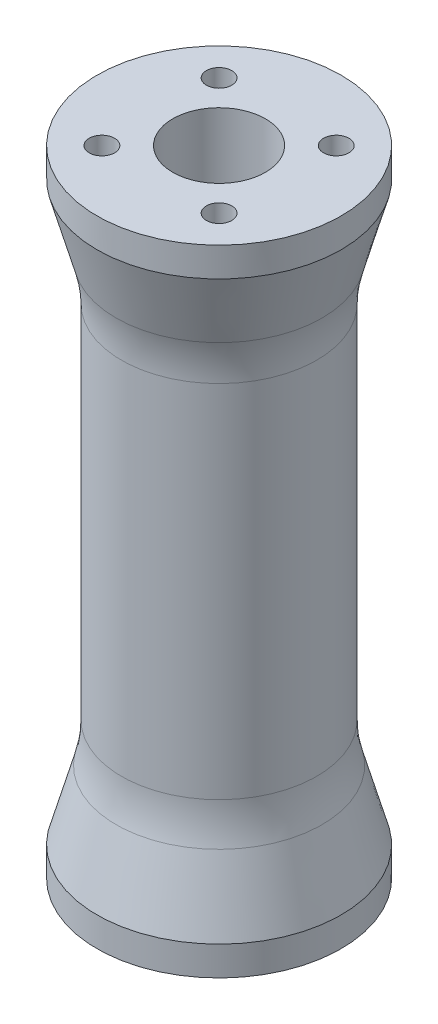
from build123d import *

# Parameters (mm, degrees)
SKETCH2_R          = 1.3
CUT_EXTRUDE1_DEPTH = 7
SKETCH5_R          = 4.75
CUT_EXTRUDE2_DEPTH = 68.360967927
FILLET1_R          = 15
FILLET2_R          = 4


with BuildPart() as part:
    # Sketch1 → Revolve1 (revolve)
    with BuildSketch(Plane.XY, mode=Mode.PRIVATE) as revolve1_sk:
        Polygon((0, -32.5), (0, 32.5), (-12.5, 32.5), (-12.5, 29.5), (-10, 20.5), (-10, -20.5), (-12.5, -29.5), (-12.5, -32.5), align=None)
    revolve(revolve1_sk.sketch.rotate(Axis((0, -32.5, 0), (0, 1, 0)), 270), axis=Axis((0, -32.5, 0), (0, 1, 0)))

    # Sketch2 → Cut-Extrude1 (cut)
    with BuildSketch(Plane(origin=(0, 32.5, 0), x_dir=(1, 0, 0), z_dir=(0, 1, 0))):
        with Locations(Location((-6, 6, 0), (0, 0, 270))):
            Circle(SKETCH2_R)
        with Locations(Location((6, 6, 0), (0, 0, 270))):
            Circle(SKETCH2_R)
        with Locations(Location((-6, -6, 0), (0, 0, 270))):
            Circle(SKETCH2_R)
        with Locations(Location((6, -6, 0), (0, 0, 270))):
            Circle(SKETCH2_R)
    cut_extrude1 = extrude(amount=-CUT_EXTRUDE1_DEPTH, mode=Mode.SUBTRACT)

    # Mirror1: Cut-Extrude1 across plane
    add(cut_extrude1.mirror(Plane.ZX), mode=Mode.SUBTRACT)

    # Sketch4 → Cut-Revolve1 (revolve, cut)
    with BuildSketch(Plane.XY):
        Polygon((0, 29.7), (-9, 20.7), (-9, -20.7), (0, -29.7), align=None)
    revolve(axis=Axis((0, 29.7, 0), (0, -1, 0)), mode=Mode.SUBTRACT)

    # Sketch5 → Cut-Extrude2 (cut, through all)
    with BuildSketch(Plane(origin=(0, 32.5, 0), x_dir=(1, 0, 0), z_dir=(0, 1, 0))):
        with Locations(Location((0, 0, 0), (0, 0, 270))):
            Circle(SKETCH5_R)
    extrude(amount=-CUT_EXTRUDE2_DEPTH, mode=Mode.SUBTRACT)

    # Fillet1
    fillet1_edges = [part.edges().sort_by_distance(p)[0] for p in [
        (0, -20.5, 10),
        (0, 20.5, 10),
    ]]
    fillet(fillet1_edges, radius=FILLET1_R)

    # Fillet2
    fillet2_edges = [part.edges().sort_by_distance(p)[0] for p in [
        (9, -20.7, 0),
        (9, 20.7, 0),
    ]]
    fillet(fillet2_edges, radius=FILLET2_R)


solid = part.part
